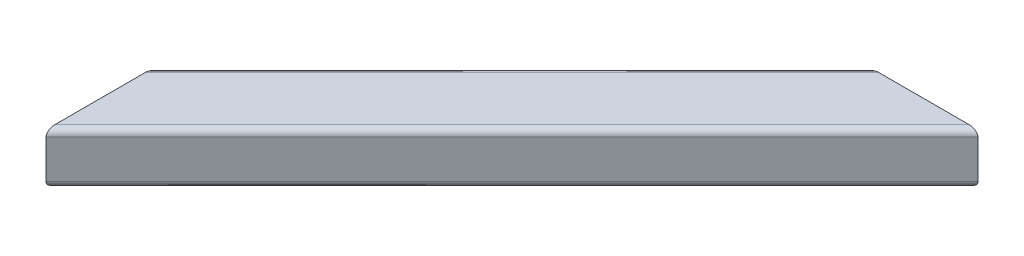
ISO-10303-21;
HEADER;
FILE_DESCRIPTION(('STEP AP214'),'2;1');
FILE_NAME('part.step','',(''),(''),'','','');
FILE_SCHEMA(('AUTOMOTIVE_DESIGN { 1 0 10303 214 1 1 1 1 }'));
ENDSEC;
DATA;
#1=APPLICATION_CONTEXT('core data for automotive mechanical design processes');
#2=APPLICATION_PROTOCOL_DEFINITION('international standard','automotive_design',2000,#1);
#3=PRODUCT_CONTEXT('',#1,'mechanical');
#4=PRODUCT('Part','Part','',(#3));
#5=PRODUCT_RELATED_PRODUCT_CATEGORY('part','',(#4));
#6=PRODUCT_DEFINITION_FORMATION('','',#4);
#7=PRODUCT_DEFINITION_CONTEXT('part definition',#1,'design');
#8=PRODUCT_DEFINITION('design','',#6,#7);
#9=PRODUCT_DEFINITION_SHAPE('','',#8);
#10=(LENGTH_UNIT() NAMED_UNIT(*) SI_UNIT(.MILLI.,.METRE.));
#11=(NAMED_UNIT(*) PLANE_ANGLE_UNIT() SI_UNIT($,.RADIAN.));
#12=(NAMED_UNIT(*) SI_UNIT($,.STERADIAN.) SOLID_ANGLE_UNIT());
#13=UNCERTAINTY_MEASURE_WITH_UNIT(LENGTH_MEASURE(1.E-05),#10,'distance_accuracy_value','');
#14=(GEOMETRIC_REPRESENTATION_CONTEXT(3) GLOBAL_UNCERTAINTY_ASSIGNED_CONTEXT((#13)) GLOBAL_UNIT_ASSIGNED_CONTEXT((#10,
#11,#12)) REPRESENTATION_CONTEXT('',''));
#15=CARTESIAN_POINT('',(0.,0.,0.));
#16=DIRECTION('',(0.,0.,1.));
#17=DIRECTION('',(1.,0.,0.));
#18=AXIS2_PLACEMENT_3D('',#15,#16,#17);
#19=CARTESIAN_POINT('',(-735.829489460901,-34.9999999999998,442.951400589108));
#20=DIRECTION('',(0.,1.,0.));
#21=DIRECTION('',(-1.,0.,0.));
#22=AXIS2_PLACEMENT_3D('',#19,#20,#21);
#23=PLANE('',#22);
#24=DIRECTION('',(0.707106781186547,0.,-0.707106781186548));
#25=VECTOR('',#24,1.);
#26=CARTESIAN_POINT('',(-806.540167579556,-35.0000000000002,372.240722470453));
#27=LINE('',#26,#25);
#28=CARTESIAN_POINT('',(8.89420183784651,-35.0000000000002,-443.193646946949));
#29=VERTEX_POINT('',#28);
#30=CARTESIAN_POINT('',(582.117506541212,-35.0000000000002,-1016.41695165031));
#31=VERTEX_POINT('',#30);
#32=EDGE_CURVE('E69',#29,#31,#27,.T.);
#33=ORIENTED_EDGE('',*,*,#32,.F.);
#34=DIRECTION('',(0.,0.,1.));
#35=VECTOR('',#34,1.);
#36=CARTESIAN_POINT('',(8.8942018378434,-34.9999999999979,442.95140058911));
#37=LINE('',#36,#35);
#38=CARTESIAN_POINT('',(8.89420183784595,-34.9999999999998,-301.772290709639));
#39=VERTEX_POINT('',#38);
#40=EDGE_CURVE('E110',#29,#39,#37,.T.);
#41=ORIENTED_EDGE('',*,*,#40,.T.);
#42=DIRECTION('',(0.707106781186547,0.,-0.707106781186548));
#43=VECTOR('',#42,1.);
#44=CARTESIAN_POINT('',(-735.829489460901,-34.9999999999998,442.951400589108));
#45=LINE('',#44,#43);
#46=CARTESIAN_POINT('',(723.538862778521,-34.9999999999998,-1016.41695165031));
#47=VERTEX_POINT('',#46);
#48=EDGE_CURVE('E200',#39,#47,#45,.T.);
#49=ORIENTED_EDGE('',*,*,#48,.T.);
#50=DIRECTION('',(1.,0.,0.));
#51=VECTOR('',#50,1.);
#52=CARTESIAN_POINT('',(-735.829489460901,-35.0000000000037,-1016.41695165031));
#53=LINE('',#52,#51);
#54=EDGE_CURVE('E193',#31,#47,#53,.T.);
#55=ORIENTED_EDGE('',*,*,#54,.F.);
#56=EDGE_LOOP('',(#33,#41,#49,#55));
#57=FACE_BOUND('',#56,.T.);
#58=ADVANCED_FACE('F65',(#57),#23,.T.);
#59=CARTESIAN_POINT('',(-735.829489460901,-29.9999999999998,442.951400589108));
#60=DIRECTION('',(0.707106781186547,0.,-0.707106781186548));
#61=DIRECTION('',(-0.707106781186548,0.,-0.707106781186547));
#62=AXIS2_PLACEMENT_3D('',#59,#60,#61);
#63=CYLINDRICAL_SURFACE('',#62,4.99999999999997);
#64=ORIENTED_EDGE('',*,*,#48,.F.);
#65=CARTESIAN_POINT('',(8.89420183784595,-29.9999999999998,-301.772290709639));
#66=DIRECTION('',(-1.,0.,0.));
#67=DIRECTION('',(0.,0.,-1.));
#68=AXIS2_PLACEMENT_3D('',#65,#66,#67);
#69=ELLIPSE('',#68,7.07106781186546,4.99999999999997);
#70=CARTESIAN_POINT('',(8.89420183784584,-29.9999999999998,-294.701222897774));
#71=VERTEX_POINT('',#70);
#72=EDGE_CURVE('E84',#39,#71,#69,.T.);
#73=ORIENTED_EDGE('',*,*,#72,.T.);
#74=DIRECTION('',(0.707106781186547,0.,-0.707106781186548));
#75=VECTOR('',#74,1.);
#76=CARTESIAN_POINT('',(-732.293955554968,-29.9999999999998,446.48693449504));
#77=LINE('',#76,#75);
#78=CARTESIAN_POINT('',(730.609930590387,-29.9999999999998,-1016.41695165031));
#79=VERTEX_POINT('',#78);
#80=EDGE_CURVE('E256',#71,#79,#77,.T.);
#81=ORIENTED_EDGE('',*,*,#80,.T.);
#82=CARTESIAN_POINT('',(723.538862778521,-29.9999999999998,-1016.41695165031));
#83=DIRECTION('',(0.,0.,1.));
#84=DIRECTION('',(1.,0.,0.));
#85=AXIS2_PLACEMENT_3D('',#82,#83,#84);
#86=ELLIPSE('',#85,7.07106781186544,4.99999999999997);
#87=EDGE_CURVE('E201',#47,#79,#86,.T.);
#88=ORIENTED_EDGE('',*,*,#87,.F.);
#89=EDGE_LOOP('',(#64,#73,#81,#88));
#90=FACE_BOUND('',#89,.T.);
#91=ADVANCED_FACE('F294',(#90),#63,.F.);
#92=CARTESIAN_POINT('',(-732.293955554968,-29.9999999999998,446.48693449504));
#93=DIRECTION('',(-0.707106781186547,0.,-0.707106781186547));
#94=DIRECTION('',(-0.707106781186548,0.,0.707106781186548));
#95=AXIS2_PLACEMENT_3D('',#92,#93,#94);
#96=PLANE('',#95);
#97=ORIENTED_EDGE('',*,*,#80,.F.);
#98=DIRECTION('',(0.,1.,0.));
#99=VECTOR('',#98,1.);
#100=CARTESIAN_POINT('',(8.89420183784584,-30.0000000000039,-294.701222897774));
#101=LINE('',#100,#99);
#102=CARTESIAN_POINT('',(8.89420183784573,30.0000000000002,-294.701222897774));
#103=VERTEX_POINT('',#102);
#104=EDGE_CURVE('E257',#71,#103,#101,.T.);
#105=ORIENTED_EDGE('',*,*,#104,.T.);
#106=DIRECTION('',(0.707106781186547,0.,-0.707106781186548));
#107=VECTOR('',#106,1.);
#108=CARTESIAN_POINT('',(-732.293955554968,30.0000000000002,446.48693449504));
#109=LINE('',#108,#107);
#110=CARTESIAN_POINT('',(730.609930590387,30.0000000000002,-1016.41695165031));
#111=VERTEX_POINT('',#110);
#112=EDGE_CURVE('E260',#103,#111,#109,.T.);
#113=ORIENTED_EDGE('',*,*,#112,.T.);
#114=DIRECTION('',(0.,1.,0.));
#115=VECTOR('',#114,1.);
#116=CARTESIAN_POINT('',(730.609930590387,-29.9999999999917,-1016.41695165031));
#117=LINE('',#116,#115);
#118=EDGE_CURVE('E203',#79,#111,#117,.T.);
#119=ORIENTED_EDGE('',*,*,#118,.F.);
#120=EDGE_LOOP('',(#97,#105,#113,#119));
#121=FACE_BOUND('',#120,.T.);
#122=ADVANCED_FACE('F300',(#121),#96,.T.);
#123=CARTESIAN_POINT('',(-735.829489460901,30.0000000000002,442.951400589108));
#124=DIRECTION('',(0.707106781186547,0.,-0.707106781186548));
#125=DIRECTION('',(-0.707106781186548,0.,-0.707106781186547));
#126=AXIS2_PLACEMENT_3D('',#123,#124,#125);
#127=CYLINDRICAL_SURFACE('',#126,4.99999999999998);
#128=ORIENTED_EDGE('',*,*,#112,.F.);
#129=CARTESIAN_POINT('',(8.89420183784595,30.0000000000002,-301.772290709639));
#130=DIRECTION('',(-1.,0.,0.));
#131=DIRECTION('',(0.,0.,-1.));
#132=AXIS2_PLACEMENT_3D('',#129,#130,#131);
#133=ELLIPSE('',#132,7.07106781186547,4.99999999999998);
#134=CARTESIAN_POINT('',(8.89420183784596,35.0000000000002,-301.772290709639));
#135=VERTEX_POINT('',#134);
#136=EDGE_CURVE('E261',#103,#135,#133,.T.);
#137=ORIENTED_EDGE('',*,*,#136,.T.);
#138=DIRECTION('',(0.707106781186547,0.,-0.707106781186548));
#139=VECTOR('',#138,1.);
#140=CARTESIAN_POINT('',(-735.829489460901,35.0000000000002,442.951400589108));
#141=LINE('',#140,#139);
#142=CARTESIAN_POINT('',(723.538862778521,35.0000000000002,-1016.41695165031));
#143=VERTEX_POINT('',#142);
#144=EDGE_CURVE('E264',#135,#143,#141,.T.);
#145=ORIENTED_EDGE('',*,*,#144,.T.);
#146=CARTESIAN_POINT('',(723.538862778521,30.0000000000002,-1016.41695165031));
#147=DIRECTION('',(0.,0.,1.));
#148=DIRECTION('',(1.,0.,0.));
#149=AXIS2_PLACEMENT_3D('',#146,#147,#148);
#150=ELLIPSE('',#149,7.07106781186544,4.99999999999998);
#151=EDGE_CURVE('E302',#111,#143,#150,.T.);
#152=ORIENTED_EDGE('',*,*,#151,.F.);
#153=EDGE_LOOP('',(#128,#137,#145,#152));
#154=FACE_BOUND('',#153,.T.);
#155=ADVANCED_FACE('F362',(#154),#127,.F.);
#156=CARTESIAN_POINT('',(-806.540167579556,34.9999999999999,372.240722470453));
#157=DIRECTION('',(0.,-1.,0.));
#158=DIRECTION('',(1.,0.,0.));
#159=AXIS2_PLACEMENT_3D('',#156,#157,#158);
#160=PLANE('',#159);
#161=ORIENTED_EDGE('',*,*,#144,.F.);
#162=DIRECTION('',(0.,0.,-1.));
#163=VECTOR('',#162,1.);
#164=CARTESIAN_POINT('',(8.89420183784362,35.0000000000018,372.240722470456));
#165=LINE('',#164,#163);
#166=CARTESIAN_POINT('',(8.89420183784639,34.9999999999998,-443.19364694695));
#167=VERTEX_POINT('',#166);
#168=EDGE_CURVE('E265',#135,#167,#165,.T.);
#169=ORIENTED_EDGE('',*,*,#168,.T.);
#170=DIRECTION('',(0.707106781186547,0.,-0.707106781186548));
#171=VECTOR('',#170,1.);
#172=CARTESIAN_POINT('',(-806.540167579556,34.9999999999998,372.240722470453));
#173=LINE('',#172,#171);
#174=CARTESIAN_POINT('',(582.117506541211,34.9999999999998,-1016.41695165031));
#175=VERTEX_POINT('',#174);
#176=EDGE_CURVE('E268',#167,#175,#173,.T.);
#177=ORIENTED_EDGE('',*,*,#176,.T.);
#178=DIRECTION('',(-1.,0.,0.));
#179=VECTOR('',#178,1.);
#180=CARTESIAN_POINT('',(-806.540167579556,34.9999999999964,-1016.41695165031));
#181=LINE('',#180,#179);
#182=EDGE_CURVE('E303',#143,#175,#181,.T.);
#183=ORIENTED_EDGE('',*,*,#182,.F.);
#184=EDGE_LOOP('',(#161,#169,#177,#183));
#185=FACE_BOUND('',#184,.T.);
#186=ADVANCED_FACE('F365',(#185),#160,.T.);
#187=CARTESIAN_POINT('',(-806.540167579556,29.9999999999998,372.240722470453));
#188=DIRECTION('',(0.707106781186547,0.,-0.707106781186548));
#189=DIRECTION('',(-0.707106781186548,0.,-0.707106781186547));
#190=AXIS2_PLACEMENT_3D('',#187,#188,#189);
#191=CYLINDRICAL_SURFACE('',#190,4.99999999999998);
#192=ORIENTED_EDGE('',*,*,#176,.F.);
#193=CARTESIAN_POINT('',(8.89420183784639,29.9999999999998,-443.19364694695));
#194=DIRECTION('',(-1.,0.,0.));
#195=DIRECTION('',(0.,0.,-1.));
#196=AXIS2_PLACEMENT_3D('',#193,#194,#195);
#197=ELLIPSE('',#196,7.07106781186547,4.99999999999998);
#198=CARTESIAN_POINT('',(8.89420183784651,29.9999999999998,-450.264714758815));
#199=VERTEX_POINT('',#198);
#200=EDGE_CURVE('E269',#167,#199,#197,.T.);
#201=ORIENTED_EDGE('',*,*,#200,.T.);
#202=DIRECTION('',(0.707106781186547,0.,-0.707106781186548));
#203=VECTOR('',#202,1.);
#204=CARTESIAN_POINT('',(-810.075701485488,29.9999999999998,368.70518856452));
#205=LINE('',#204,#203);
#206=CARTESIAN_POINT('',(575.046438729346,29.9999999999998,-1016.41695165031));
#207=VERTEX_POINT('',#206);
#208=EDGE_CURVE('E272',#199,#207,#205,.T.);
#209=ORIENTED_EDGE('',*,*,#208,.T.);
#210=CARTESIAN_POINT('',(582.117506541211,29.9999999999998,-1016.41695165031));
#211=DIRECTION('',(0.,0.,1.));
#212=DIRECTION('',(1.,0.,0.));
#213=AXIS2_PLACEMENT_3D('',#210,#211,#212);
#214=ELLIPSE('',#213,7.07106781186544,4.99999999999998);
#215=EDGE_CURVE('E308',#175,#207,#214,.T.);
#216=ORIENTED_EDGE('',*,*,#215,.F.);
#217=EDGE_LOOP('',(#192,#201,#209,#216));
#218=FACE_BOUND('',#217,.T.);
#219=ADVANCED_FACE('F369',(#218),#191,.F.);
#220=CARTESIAN_POINT('',(-810.075701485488,29.9999999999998,368.70518856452));
#221=DIRECTION('',(0.707106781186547,0.,0.707106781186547));
#222=DIRECTION('',(0.707106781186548,0.,-0.707106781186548));
#223=AXIS2_PLACEMENT_3D('',#220,#221,#222);
#224=PLANE('',#223);
#225=ORIENTED_EDGE('',*,*,#208,.F.);
#226=DIRECTION('',(0.,-1.,0.));
#227=VECTOR('',#226,1.);
#228=CARTESIAN_POINT('',(8.89420183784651,29.9999999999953,-450.264714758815));
#229=LINE('',#228,#227);
#230=CARTESIAN_POINT('',(8.89420183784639,-30.0000000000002,-450.264714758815));
#231=VERTEX_POINT('',#230);
#232=EDGE_CURVE('E273',#199,#231,#229,.T.);
#233=ORIENTED_EDGE('',*,*,#232,.T.);
#234=DIRECTION('',(0.707106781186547,0.,-0.707106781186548));
#235=VECTOR('',#234,1.);
#236=CARTESIAN_POINT('',(-810.075701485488,-30.0000000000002,368.70518856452));
#237=LINE('',#236,#235);
#238=CARTESIAN_POINT('',(575.046438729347,-30.0000000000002,-1016.41695165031));
#239=VERTEX_POINT('',#238);
#240=EDGE_CURVE('E235',#231,#239,#237,.T.);
#241=ORIENTED_EDGE('',*,*,#240,.T.);
#242=DIRECTION('',(0.,-1.,0.));
#243=VECTOR('',#242,1.);
#244=CARTESIAN_POINT('',(575.046438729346,30.0000000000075,-1016.41695165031));
#245=LINE('',#244,#243);
#246=EDGE_CURVE('E197',#207,#239,#245,.T.);
#247=ORIENTED_EDGE('',*,*,#246,.F.);
#248=EDGE_LOOP('',(#225,#233,#241,#247));
#249=FACE_BOUND('',#248,.T.);
#250=ADVANCED_FACE('F373',(#249),#224,.T.);
#251=CARTESIAN_POINT('',(-806.540167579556,-30.0000000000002,372.240722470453));
#252=DIRECTION('',(0.707106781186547,0.,-0.707106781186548));
#253=DIRECTION('',(-0.707106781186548,0.,-0.707106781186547));
#254=AXIS2_PLACEMENT_3D('',#251,#252,#253);
#255=CYLINDRICAL_SURFACE('',#254,4.99999999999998);
#256=ORIENTED_EDGE('',*,*,#240,.F.);
#257=CARTESIAN_POINT('',(8.89420183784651,-30.0000000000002,-443.193646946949));
#258=DIRECTION('',(-1.,0.,0.));
#259=DIRECTION('',(0.,0.,-1.));
#260=AXIS2_PLACEMENT_3D('',#257,#258,#259);
#261=ELLIPSE('',#260,7.07106781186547,4.99999999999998);
#262=EDGE_CURVE('E106',#231,#29,#261,.T.);
#263=ORIENTED_EDGE('',*,*,#262,.T.);
#264=ORIENTED_EDGE('',*,*,#32,.T.);
#265=CARTESIAN_POINT('',(582.117506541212,-30.0000000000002,-1016.41695165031));
#266=DIRECTION('',(0.,0.,1.));
#267=DIRECTION('',(1.,0.,0.));
#268=AXIS2_PLACEMENT_3D('',#265,#266,#267);
#269=ELLIPSE('',#268,7.07106781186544,4.99999999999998);
#270=EDGE_CURVE('E183',#239,#31,#269,.T.);
#271=ORIENTED_EDGE('',*,*,#270,.F.);
#272=EDGE_LOOP('',(#256,#263,#264,#271));
#273=FACE_BOUND('',#272,.T.);
#274=ADVANCED_FACE('F182',(#273),#255,.F.);
#275=CARTESIAN_POINT('',(-806.540167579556,39.9999999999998,372.240722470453));
#276=DIRECTION('',(0.,-1.,0.));
#277=DIRECTION('',(1.,0.,0.));
#278=AXIS2_PLACEMENT_3D('',#275,#276,#277);
#279=PLANE('',#278);
#280=DIRECTION('',(0.,0.,-1.));
#281=VECTOR('',#280,1.);
#282=CARTESIAN_POINT('',(8.89420183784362,40.0000000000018,372.240722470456));
#283=LINE('',#282,#281);
#284=CARTESIAN_POINT('',(8.89420183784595,40.0000000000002,-301.772290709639));
#285=VERTEX_POINT('',#284);
#286=CARTESIAN_POINT('',(8.89420183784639,39.9999999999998,-443.19364694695));
#287=VERTEX_POINT('',#286);
#288=EDGE_CURVE('E236',#285,#287,#283,.T.);
#289=ORIENTED_EDGE('',*,*,#288,.F.);
#290=DIRECTION('',(0.707106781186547,0.,-0.707106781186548));
#291=VECTOR('',#290,1.);
#292=CARTESIAN_POINT('',(-735.829489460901,40.0000000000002,442.951400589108));
#293=LINE('',#292,#291);
#294=CARTESIAN_POINT('',(723.538862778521,40.0000000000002,-1016.41695165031));
#295=VERTEX_POINT('',#294);
#296=EDGE_CURVE('E186',#285,#295,#293,.T.);
#297=ORIENTED_EDGE('',*,*,#296,.T.);
#298=DIRECTION('',(-1.,0.,0.));
#299=VECTOR('',#298,1.);
#300=CARTESIAN_POINT('',(-806.540167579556,39.9999999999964,-1016.41695165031));
#301=LINE('',#300,#299);
#302=CARTESIAN_POINT('',(582.117506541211,39.9999999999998,-1016.41695165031));
#303=VERTEX_POINT('',#302);
#304=EDGE_CURVE('E283',#295,#303,#301,.T.);
#305=ORIENTED_EDGE('',*,*,#304,.T.);
#306=DIRECTION('',(0.707106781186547,0.,-0.707106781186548));
#307=VECTOR('',#306,1.);
#308=CARTESIAN_POINT('',(-806.540167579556,39.9999999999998,372.240722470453));
#309=LINE('',#308,#307);
#310=EDGE_CURVE('E209',#287,#303,#309,.T.);
#311=ORIENTED_EDGE('',*,*,#310,.F.);
#312=EDGE_LOOP('',(#289,#297,#305,#311));
#313=FACE_BOUND('',#312,.T.);
#314=ADVANCED_FACE('F314',(#313),#279,.F.);
#315=CARTESIAN_POINT('',(-735.829489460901,30.0000000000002,442.951400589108));
#316=DIRECTION('',(0.707106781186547,0.,-0.707106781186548));
#317=DIRECTION('',(-0.707106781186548,0.,-0.707106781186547));
#318=AXIS2_PLACEMENT_3D('',#315,#316,#317);
#319=CYLINDRICAL_SURFACE('',#318,10.);
#320=CARTESIAN_POINT('',(8.89420183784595,30.0000000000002,-301.772290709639));
#321=DIRECTION('',(-1.,0.,0.));
#322=DIRECTION('',(0.,0.,-1.));
#323=AXIS2_PLACEMENT_3D('',#320,#321,#322);
#324=ELLIPSE('',#323,14.142135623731,10.);
#325=CARTESIAN_POINT('',(8.89420183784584,30.0000000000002,-287.630155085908));
#326=VERTEX_POINT('',#325);
#327=EDGE_CURVE('E240',#326,#285,#324,.T.);
#328=ORIENTED_EDGE('',*,*,#327,.F.);
#329=DIRECTION('',(0.707106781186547,0.,-0.707106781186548));
#330=VECTOR('',#329,1.);
#331=CARTESIAN_POINT('',(-728.758421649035,30.0000000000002,450.022468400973));
#332=LINE('',#331,#330);
#333=CARTESIAN_POINT('',(737.680998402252,30.0000000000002,-1016.41695165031));
#334=VERTEX_POINT('',#333);
#335=EDGE_CURVE('E233',#326,#334,#332,.T.);
#336=ORIENTED_EDGE('',*,*,#335,.T.);
#337=CARTESIAN_POINT('',(723.538862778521,30.0000000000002,-1016.41695165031));
#338=DIRECTION('',(0.,0.,1.));
#339=DIRECTION('',(1.,0.,0.));
#340=AXIS2_PLACEMENT_3D('',#337,#338,#339);
#341=ELLIPSE('',#340,14.142135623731,10.);
#342=EDGE_CURVE('E230',#334,#295,#341,.T.);
#343=ORIENTED_EDGE('',*,*,#342,.T.);
#344=ORIENTED_EDGE('',*,*,#296,.F.);
#345=EDGE_LOOP('',(#328,#336,#343,#344));
#346=FACE_BOUND('',#345,.T.);
#347=ADVANCED_FACE('F322',(#346),#319,.T.);
#348=CARTESIAN_POINT('',(-728.758421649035,-29.9999999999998,450.022468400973));
#349=DIRECTION('',(-0.707106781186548,0.,-0.707106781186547));
#350=DIRECTION('',(-0.707106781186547,0.,0.707106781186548));
#351=AXIS2_PLACEMENT_3D('',#348,#349,#350);
#352=PLANE('',#351);
#353=DIRECTION('',(0.,1.,0.));
#354=VECTOR('',#353,1.);
#355=CARTESIAN_POINT('',(8.89420183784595,-30.0000000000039,-287.630155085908));
#356=LINE('',#355,#354);
#357=CARTESIAN_POINT('',(8.89420183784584,-29.9999999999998,-287.630155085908));
#358=VERTEX_POINT('',#357);
#359=EDGE_CURVE('E13',#358,#326,#356,.T.);
#360=ORIENTED_EDGE('',*,*,#359,.F.);
#361=DIRECTION('',(0.707106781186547,0.,-0.707106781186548));
#362=VECTOR('',#361,1.);
#363=CARTESIAN_POINT('',(-728.758421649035,-29.9999999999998,450.022468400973));
#364=LINE('',#363,#362);
#365=CARTESIAN_POINT('',(737.680998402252,-29.9999999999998,-1016.41695165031));
#366=VERTEX_POINT('',#365);
#367=EDGE_CURVE('E229',#358,#366,#364,.T.);
#368=ORIENTED_EDGE('',*,*,#367,.T.);
#369=DIRECTION('',(0.,1.,0.));
#370=VECTOR('',#369,1.);
#371=CARTESIAN_POINT('',(737.680998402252,-29.9999999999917,-1016.41695165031));
#372=LINE('',#371,#370);
#373=EDGE_CURVE('E226',#366,#334,#372,.T.);
#374=ORIENTED_EDGE('',*,*,#373,.T.);
#375=ORIENTED_EDGE('',*,*,#335,.F.);
#376=EDGE_LOOP('',(#360,#368,#374,#375));
#377=FACE_BOUND('',#376,.T.);
#378=ADVANCED_FACE('F325',(#377),#352,.F.);
#379=CARTESIAN_POINT('',(-735.829489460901,-29.9999999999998,442.951400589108));
#380=DIRECTION('',(0.707106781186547,0.,-0.707106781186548));
#381=DIRECTION('',(-0.707106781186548,0.,-0.707106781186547));
#382=AXIS2_PLACEMENT_3D('',#379,#380,#381);
#383=CYLINDRICAL_SURFACE('',#382,10.);
#384=CARTESIAN_POINT('',(8.89420183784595,-29.9999999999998,-301.772290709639));
#385=DIRECTION('',(-1.,0.,0.));
#386=DIRECTION('',(0.,0.,-1.));
#387=AXIS2_PLACEMENT_3D('',#384,#385,#386);
#388=ELLIPSE('',#387,14.142135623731,10.);
#389=CARTESIAN_POINT('',(8.89420183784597,-39.9999999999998,-301.772290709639));
#390=VERTEX_POINT('',#389);
#391=EDGE_CURVE('E75',#390,#358,#388,.T.);
#392=ORIENTED_EDGE('',*,*,#391,.F.);
#393=DIRECTION('',(0.707106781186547,0.,-0.707106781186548));
#394=VECTOR('',#393,1.);
#395=CARTESIAN_POINT('',(-735.829489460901,-39.9999999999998,442.951400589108));
#396=LINE('',#395,#394);
#397=CARTESIAN_POINT('',(723.538862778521,-39.9999999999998,-1016.41695165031));
#398=VERTEX_POINT('',#397);
#399=EDGE_CURVE('E225',#390,#398,#396,.T.);
#400=ORIENTED_EDGE('',*,*,#399,.T.);
#401=CARTESIAN_POINT('',(723.538862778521,-29.9999999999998,-1016.41695165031));
#402=DIRECTION('',(0.,0.,1.));
#403=DIRECTION('',(1.,0.,0.));
#404=AXIS2_PLACEMENT_3D('',#401,#402,#403);
#405=ELLIPSE('',#404,14.142135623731,10.);
#406=EDGE_CURVE('E222',#398,#366,#405,.T.);
#407=ORIENTED_EDGE('',*,*,#406,.T.);
#408=ORIENTED_EDGE('',*,*,#367,.F.);
#409=EDGE_LOOP('',(#392,#400,#407,#408));
#410=FACE_BOUND('',#409,.T.);
#411=ADVANCED_FACE('F330',(#410),#383,.T.);
#412=CARTESIAN_POINT('',(-735.829489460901,-39.9999999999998,442.951400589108));
#413=DIRECTION('',(0.,1.,0.));
#414=DIRECTION('',(-1.,0.,0.));
#415=AXIS2_PLACEMENT_3D('',#412,#413,#414);
#416=PLANE('',#415);
#417=DIRECTION('',(0.,0.,1.));
#418=VECTOR('',#417,1.);
#419=CARTESIAN_POINT('',(8.8942018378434,-39.9999999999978,442.95140058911));
#420=LINE('',#419,#418);
#421=CARTESIAN_POINT('',(8.89420183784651,-40.0000000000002,-443.193646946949));
#422=VERTEX_POINT('',#421);
#423=EDGE_CURVE('E245',#422,#390,#420,.T.);
#424=ORIENTED_EDGE('',*,*,#423,.F.);
#425=DIRECTION('',(0.707106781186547,0.,-0.707106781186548));
#426=VECTOR('',#425,1.);
#427=CARTESIAN_POINT('',(-806.540167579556,-40.0000000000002,372.240722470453));
#428=LINE('',#427,#426);
#429=CARTESIAN_POINT('',(582.117506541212,-40.0000000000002,-1016.41695165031));
#430=VERTEX_POINT('',#429);
#431=EDGE_CURVE('E221',#422,#430,#428,.T.);
#432=ORIENTED_EDGE('',*,*,#431,.T.);
#433=DIRECTION('',(1.,0.,0.));
#434=VECTOR('',#433,1.);
#435=CARTESIAN_POINT('',(-735.829489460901,-40.0000000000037,-1016.41695165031));
#436=LINE('',#435,#434);
#437=EDGE_CURVE('E218',#430,#398,#436,.T.);
#438=ORIENTED_EDGE('',*,*,#437,.T.);
#439=ORIENTED_EDGE('',*,*,#399,.F.);
#440=EDGE_LOOP('',(#424,#432,#438,#439));
#441=FACE_BOUND('',#440,.T.);
#442=ADVANCED_FACE('F333',(#441),#416,.F.);
#443=CARTESIAN_POINT('',(-806.540167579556,-30.0000000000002,372.240722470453));
#444=DIRECTION('',(0.707106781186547,0.,-0.707106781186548));
#445=DIRECTION('',(-0.707106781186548,0.,-0.707106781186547));
#446=AXIS2_PLACEMENT_3D('',#443,#444,#445);
#447=CYLINDRICAL_SURFACE('',#446,10.);
#448=CARTESIAN_POINT('',(8.89420183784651,-30.0000000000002,-443.193646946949));
#449=DIRECTION('',(-1.,0.,0.));
#450=DIRECTION('',(0.,0.,-1.));
#451=AXIS2_PLACEMENT_3D('',#448,#449,#450);
#452=ELLIPSE('',#451,14.142135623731,10.);
#453=CARTESIAN_POINT('',(8.89420183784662,-30.0000000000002,-457.33578257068));
#454=VERTEX_POINT('',#453);
#455=EDGE_CURVE('E248',#454,#422,#452,.T.);
#456=ORIENTED_EDGE('',*,*,#455,.F.);
#457=DIRECTION('',(0.707106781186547,0.,-0.707106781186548));
#458=VECTOR('',#457,1.);
#459=CARTESIAN_POINT('',(-813.611235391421,-30.0000000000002,365.169654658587));
#460=LINE('',#459,#458);
#461=CARTESIAN_POINT('',(567.975370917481,-30.0000000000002,-1016.41695165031));
#462=VERTEX_POINT('',#461);
#463=EDGE_CURVE('E217',#454,#462,#460,.T.);
#464=ORIENTED_EDGE('',*,*,#463,.T.);
#465=CARTESIAN_POINT('',(582.117506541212,-30.0000000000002,-1016.41695165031));
#466=DIRECTION('',(0.,0.,1.));
#467=DIRECTION('',(1.,0.,0.));
#468=AXIS2_PLACEMENT_3D('',#465,#466,#467);
#469=ELLIPSE('',#468,14.142135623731,10.);
#470=EDGE_CURVE('E214',#462,#430,#469,.T.);
#471=ORIENTED_EDGE('',*,*,#470,.T.);
#472=ORIENTED_EDGE('',*,*,#431,.F.);
#473=EDGE_LOOP('',(#456,#464,#471,#472));
#474=FACE_BOUND('',#473,.T.);
#475=ADVANCED_FACE('F338',(#474),#447,.T.);
#476=CARTESIAN_POINT('',(-813.611235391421,29.9999999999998,365.169654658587));
#477=DIRECTION('',(0.707106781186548,0.,0.707106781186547));
#478=DIRECTION('',(0.707106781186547,0.,-0.707106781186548));
#479=AXIS2_PLACEMENT_3D('',#476,#477,#478);
#480=PLANE('',#479);
#481=DIRECTION('',(0.,-1.,0.));
#482=VECTOR('',#481,1.);
#483=CARTESIAN_POINT('',(8.89420183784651,29.9999999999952,-457.335782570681));
#484=LINE('',#483,#482);
#485=CARTESIAN_POINT('',(8.89420183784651,29.9999999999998,-457.335782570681));
#486=VERTEX_POINT('',#485);
#487=EDGE_CURVE('E251',#486,#454,#484,.T.);
#488=ORIENTED_EDGE('',*,*,#487,.F.);
#489=DIRECTION('',(0.707106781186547,0.,-0.707106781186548));
#490=VECTOR('',#489,1.);
#491=CARTESIAN_POINT('',(-813.611235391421,29.9999999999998,365.169654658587));
#492=LINE('',#491,#490);
#493=CARTESIAN_POINT('',(567.97537091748,29.9999999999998,-1016.41695165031));
#494=VERTEX_POINT('',#493);
#495=EDGE_CURVE('E213',#486,#494,#492,.T.);
#496=ORIENTED_EDGE('',*,*,#495,.T.);
#497=DIRECTION('',(0.,-1.,0.));
#498=VECTOR('',#497,1.);
#499=CARTESIAN_POINT('',(567.97537091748,30.0000000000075,-1016.41695165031));
#500=LINE('',#499,#498);
#501=EDGE_CURVE('E210',#494,#462,#500,.T.);
#502=ORIENTED_EDGE('',*,*,#501,.T.);
#503=ORIENTED_EDGE('',*,*,#463,.F.);
#504=EDGE_LOOP('',(#488,#496,#502,#503));
#505=FACE_BOUND('',#504,.T.);
#506=ADVANCED_FACE('F342',(#505),#480,.F.);
#507=CARTESIAN_POINT('',(-806.540167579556,29.9999999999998,372.240722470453));
#508=DIRECTION('',(0.707106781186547,0.,-0.707106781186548));
#509=DIRECTION('',(-0.707106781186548,0.,-0.707106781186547));
#510=AXIS2_PLACEMENT_3D('',#507,#508,#509);
#511=CYLINDRICAL_SURFACE('',#510,10.);
#512=CARTESIAN_POINT('',(8.89420183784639,29.9999999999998,-443.19364694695));
#513=DIRECTION('',(-1.,0.,0.));
#514=DIRECTION('',(0.,0.,-1.));
#515=AXIS2_PLACEMENT_3D('',#512,#513,#514);
#516=ELLIPSE('',#515,14.142135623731,10.);
#517=EDGE_CURVE('E239',#287,#486,#516,.T.);
#518=ORIENTED_EDGE('',*,*,#517,.F.);
#519=ORIENTED_EDGE('',*,*,#310,.T.);
#520=CARTESIAN_POINT('',(582.117506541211,29.9999999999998,-1016.41695165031));
#521=DIRECTION('',(0.,0.,1.));
#522=DIRECTION('',(1.,0.,0.));
#523=AXIS2_PLACEMENT_3D('',#520,#521,#522);
#524=ELLIPSE('',#523,14.142135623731,10.);
#525=EDGE_CURVE('E198',#303,#494,#524,.T.);
#526=ORIENTED_EDGE('',*,*,#525,.T.);
#527=ORIENTED_EDGE('',*,*,#495,.F.);
#528=EDGE_LOOP('',(#518,#519,#526,#527));
#529=FACE_BOUND('',#528,.T.);
#530=ADVANCED_FACE('F344',(#529),#511,.T.);
#531=CARTESIAN_POINT('',(0.,0.,-1016.41695165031));
#532=DIRECTION('',(0.,0.,1.));
#533=DIRECTION('',(1.,0.,0.));
#534=AXIS2_PLACEMENT_3D('',#531,#532,#533);
#535=PLANE('',#534);
#536=ORIENTED_EDGE('',*,*,#270,.T.);
#537=ORIENTED_EDGE('',*,*,#54,.T.);
#538=ORIENTED_EDGE('',*,*,#87,.T.);
#539=ORIENTED_EDGE('',*,*,#118,.T.);
#540=ORIENTED_EDGE('',*,*,#151,.T.);
#541=ORIENTED_EDGE('',*,*,#182,.T.);
#542=ORIENTED_EDGE('',*,*,#215,.T.);
#543=ORIENTED_EDGE('',*,*,#246,.T.);
#544=EDGE_LOOP('',(#536,#537,#538,#539,#540,#541,#542,#543));
#545=FACE_BOUND('',#544,.T.);
#546=ORIENTED_EDGE('',*,*,#304,.F.);
#547=ORIENTED_EDGE('',*,*,#342,.F.);
#548=ORIENTED_EDGE('',*,*,#373,.F.);
#549=ORIENTED_EDGE('',*,*,#406,.F.);
#550=ORIENTED_EDGE('',*,*,#437,.F.);
#551=ORIENTED_EDGE('',*,*,#470,.F.);
#552=ORIENTED_EDGE('',*,*,#501,.F.);
#553=ORIENTED_EDGE('',*,*,#525,.F.);
#554=EDGE_LOOP('',(#546,#547,#548,#549,#550,#551,#552,#553));
#555=FACE_BOUND('',#554,.T.);
#556=ADVANCED_FACE('F190',(#545,#555),#535,.F.);
#557=CARTESIAN_POINT('',(8.89420183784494,0.,0.));
#558=DIRECTION('',(-1.,0.,0.));
#559=DIRECTION('',(0.,0.,1.));
#560=AXIS2_PLACEMENT_3D('',#557,#558,#559);
#561=PLANE('',#560);
#562=ORIENTED_EDGE('',*,*,#40,.F.);
#563=ORIENTED_EDGE('',*,*,#262,.F.);
#564=ORIENTED_EDGE('',*,*,#232,.F.);
#565=ORIENTED_EDGE('',*,*,#200,.F.);
#566=ORIENTED_EDGE('',*,*,#168,.F.);
#567=ORIENTED_EDGE('',*,*,#136,.F.);
#568=ORIENTED_EDGE('',*,*,#104,.F.);
#569=ORIENTED_EDGE('',*,*,#72,.F.);
#570=EDGE_LOOP('',(#562,#563,#564,#565,#566,#567,#568,#569));
#571=FACE_BOUND('',#570,.T.);
#572=ORIENTED_EDGE('',*,*,#327,.T.);
#573=ORIENTED_EDGE('',*,*,#288,.T.);
#574=ORIENTED_EDGE('',*,*,#517,.T.);
#575=ORIENTED_EDGE('',*,*,#487,.T.);
#576=ORIENTED_EDGE('',*,*,#455,.T.);
#577=ORIENTED_EDGE('',*,*,#423,.T.);
#578=ORIENTED_EDGE('',*,*,#391,.T.);
#579=ORIENTED_EDGE('',*,*,#359,.T.);
#580=EDGE_LOOP('',(#572,#573,#574,#575,#576,#577,#578,#579));
#581=FACE_BOUND('',#580,.T.);
#582=ADVANCED_FACE('F67',(#571,#581),#561,.T.);
#583=CLOSED_SHELL('',(#58,#91,#122,#155,#186,#219,#250,#274,#314,#347,#378,#411,#442,#475,#506,
#530,#556,#582));
#584=MANIFOLD_SOLID_BREP('B2',#583);
#585=ADVANCED_BREP_SHAPE_REPRESENTATION('',(#18,#584),#14);
#586=SHAPE_DEFINITION_REPRESENTATION(#9,#585);
ENDSEC;
END-ISO-10303-21;
